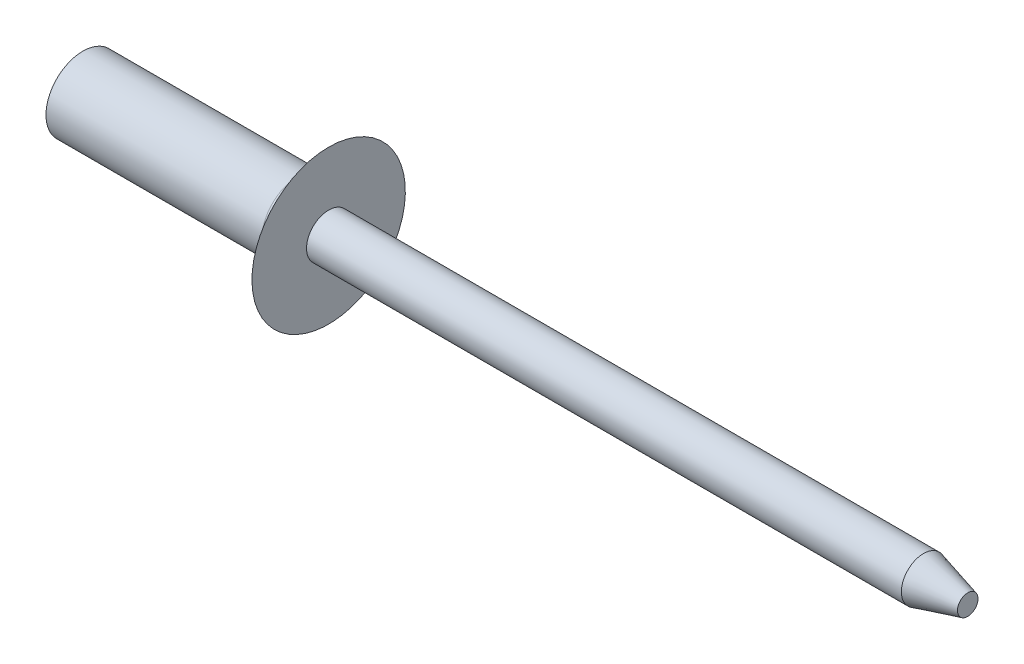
from build123d import *

# Parameters (mm, degrees)
FILLET1_R      = 0.5
CHAMFER1_SIZE  = 1.8
CHAMFER1_SIZE2 = 0.482308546


with BuildPart() as part:
    # Sketch1 → Base-Revolve (revolve)
    with BuildSketch(Plane(origin=(-20.795345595, 23.915345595, 0), x_dir=(0, -1, 0), z_dir=(0, 0, 1)), mode=Mode.PRIVATE) as base_revolve_sk:
        Polygon((23.915345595, 20.795345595), (25.415345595, 20.795345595), (25.415345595, 29.860038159), (27.035345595, 30.795345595), (24.815345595, 30.795345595), (24.815345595, 56.795345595), (23.915345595, 56.795345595), align=None)
    revolve(base_revolve_sk.sketch.rotate(Axis((30.374202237, 0, 0), (-1, 0, 0)), 180), axis=Axis((30.374202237, 0, 0), (-1, 0, 0)))

    # Fillet1
    fillet1_edges = [part.edges().sort_by_distance(p)[0] for p in [
        (9.064692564, -1.5, 0),
    ]]
    fillet(fillet1_edges, radius=FILLET1_R)

    # Chamfer1
    chamfer1_edges = [part.edges().sort_by_distance(p)[0] for p in [
        (36, -0.9, 0),
    ]]
    chamfer1_side = [part.faces().sort_by_distance(p)[0] for p in [
        (23, -0.9, 0),
    ]]
    chamfer(chamfer1_edges, length=CHAMFER1_SIZE, length2=CHAMFER1_SIZE2, reference=chamfer1_side[0])


solid = part.part
